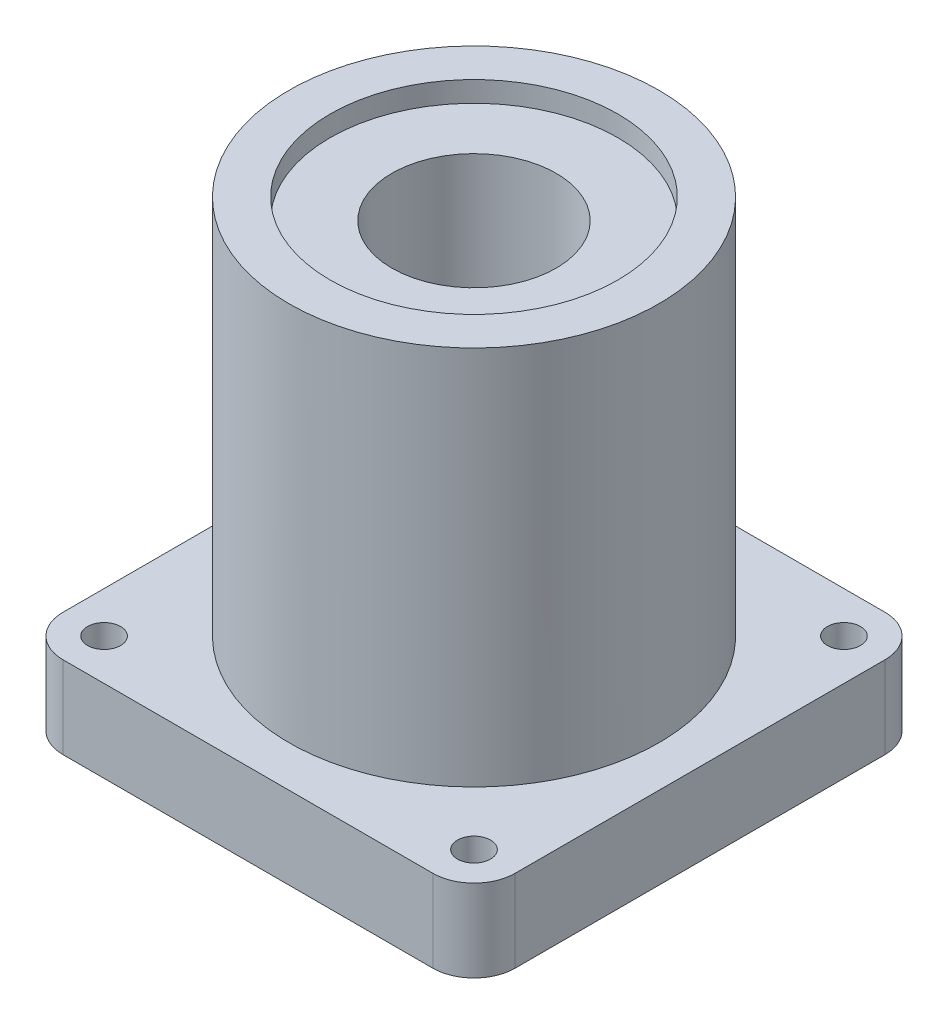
from build123d import *

# Parameters (mm, degrees)
SKETCH1_W           = 69.85
SKETCH1_H           = 69.85
BASE_EXTRUDE_DEPTH  = 12.7
SKETCH2_R           = 28.575
BOSS_EXTRUDE1_DEPTH = 71.4375
SKETCH3_R           = 12.7
CUT_EXTRUDE1_DEPTH  = 87.849453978
SKETCH4_R           = 22.225
CUT_EXTRUDE2_DEPTH  = 3.175
FILLET1_R           = 6.35
CIRPATTERN2_COUNT   = 4


with BuildPart() as part:
    # Sketch1 → Base-Extrude (new body)
    with BuildSketch(Plane(origin=(0, 0, 0), x_dir=(1, 0, 0), z_dir=(0, 1, 0))):
        Rectangle(SKETCH1_W, SKETCH1_H)
    extrude(amount=BASE_EXTRUDE_DEPTH)

    # Sketch2 → Boss-Extrude1 (add)
    with BuildSketch(Plane(origin=(0, 0, 0), x_dir=(-1, 0, 0), z_dir=(0, 1, 0))):
        with Locations(Location((0, 0, 0), (0, 0, 270))):
            Circle(SKETCH2_R)
    extrude(amount=BOSS_EXTRUDE1_DEPTH)

    # Sketch3 → Cut-Extrude1 (cut, through all)
    with BuildSketch(Plane(origin=(0, 71.4375, 0), x_dir=(-1, 0, 0), z_dir=(0, 1, 0))):
        with Locations(Location((0, 0, 0), (0, 0, 90))):
            Circle(SKETCH3_R)
    extrude(amount=-CUT_EXTRUDE1_DEPTH, mode=Mode.SUBTRACT)

    # Sketch4 → Cut-Extrude2 (cut)
    with BuildSketch(Plane(origin=(0, 71.4375, 0), x_dir=(-1, 0, 0), z_dir=(0, 1, 0))):
        with Locations(Location((0, 0, 0), (0, 0, 90))):
            Circle(SKETCH4_R)
    extrude(amount=-CUT_EXTRUDE2_DEPTH, mode=Mode.SUBTRACT)

    # Fillet1
    fillet1_edges = [part.edges().sort_by_distance(p)[0] for p in [
        (-34.925, 6.35, 34.925),
        (34.925, 6.35, 34.925),
        (34.925, 6.35, -34.925),
        (-34.925, 6.35, -34.925),
    ]]
    fillet(fillet1_edges, radius=FILLET1_R)

    # Sketch7 → 1_4-20 Tapped Hole2 (revolve, cut)
    with BuildSketch(Plane(origin=(-28.575, 12.7, -28.575), x_dir=(0, 0, 1), z_dir=(1, 0, 0))):
        Polygon((0, 0), (0, 20.583816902), (2.5527, 19.05), (2.5527, 0), align=None)
    f_1_4_20_tapped_hole2 = revolve(axis=Axis((-28.575, 19.05, -28.575), (0, -1, 0)), mode=Mode.SUBTRACT)

    # CirPattern2: 1_4-20 Tapped Hole2 ×4 about axis
    cirpattern2_axis = Axis((0, 0, 0), (0, 1, 0))
    for i in range(1, CIRPATTERN2_COUNT):
        add(f_1_4_20_tapped_hole2.rotate(cirpattern2_axis, i * 360 / CIRPATTERN2_COUNT), mode=Mode.SUBTRACT)


solid = part.part
